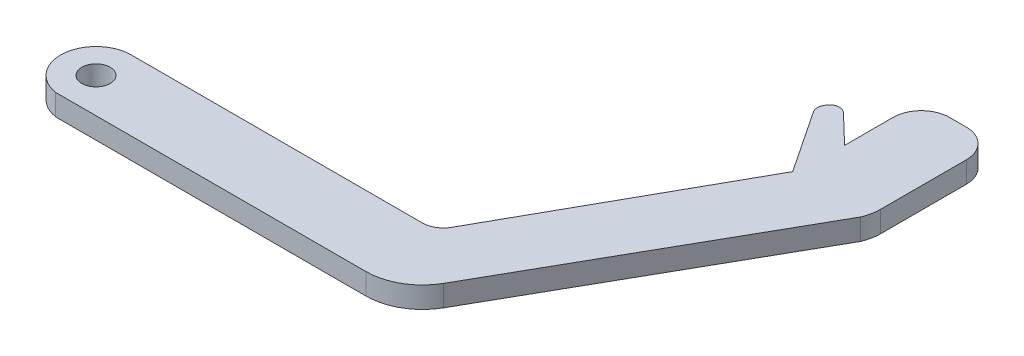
from build123d import *

# Parameters (mm, degrees)
SKETCH1_R           = 2
BOSS_EXTRUDE1_DEPTH = 3


with BuildPart() as part:
    # Sketch1 → Boss-Extrude1 (new body)
    with BuildSketch(Plane(origin=(0, 0, 0), x_dir=(1, 0, 0), z_dir=(0, 1, 0))):
        with BuildLine():
            Line((3.898979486, 5), (37.140729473, 5))
            ThreePointArc((37.140729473, 5), (38.657649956, 5.411766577), (39.758159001, 6.534031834))
            Line((39.758159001, 6.534031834), (57.051928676, 37.473901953))
            Line((57.051928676, 37.473901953), (51.190079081, 46.273394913))
            ThreePointArc((51.190079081, 46.273394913), (50.958863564, 46.948668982), (51.090598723, 47.65016847))
            Line((51.090598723, 47.65016847), (51.193753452, 47.867369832))
            ThreePointArc((51.193753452, 47.867369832), (52.206477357, 48.643917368), (53.428514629, 48.276139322))
            Line((53.428514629, 48.276139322), (57.507958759, 44.355272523))
            Line((57.507958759, 44.355272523), (57.507958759, 48.930234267))
            Line((57.507958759, 48.930234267), (57.507958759, 51.204448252))
            ThreePointArc((57.507958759, 51.204448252), (58.679531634, 54.032875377), (61.507958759, 55.204448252))
            Line((61.507958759, 55.204448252), (63.881769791, 55.204448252))
            ThreePointArc((63.881769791, 55.204448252), (66.710196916, 54.032875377), (67.881769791, 51.204448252))
            Line((67.881769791, 51.204448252), (67.881769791, 44.355272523))
            Line((67.881769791, 44.355272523), (67.881769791, 39.058138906))
            ThreePointArc((67.881769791, 39.058138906), (67.761212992, 37.861415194), (67.404387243, 36.712782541))
            Line((67.404387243, 36.712782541), (46.0589916, -0.890042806))
            ThreePointArc((46.0589916, -0.890042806), (43.127033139, -3.854295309), (39.101762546, -4.940743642))
            Line((39.101762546, -4.940743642), (3.898979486, -4.940743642))
            Line((3.898979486, -4.940743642), (0.898979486, -4.940743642))
            Line((0.898979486, -4.940743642), (-4.767497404, -4.940743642))
            ThreePointArc((-4.767497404, -4.940743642), (-8.985163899, 0.384890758), (-4, 5))
            Line((-4, 5), (0.898979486, 5))
            Line((0.898979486, 5), (3.898979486, 5))
        make_face()
        with Locations(Location((-4, 0, 0), (0, 0, 270))):
            Circle(SKETCH1_R, mode=Mode.SUBTRACT)
    extrude(amount=BOSS_EXTRUDE1_DEPTH)


solid = part.part
